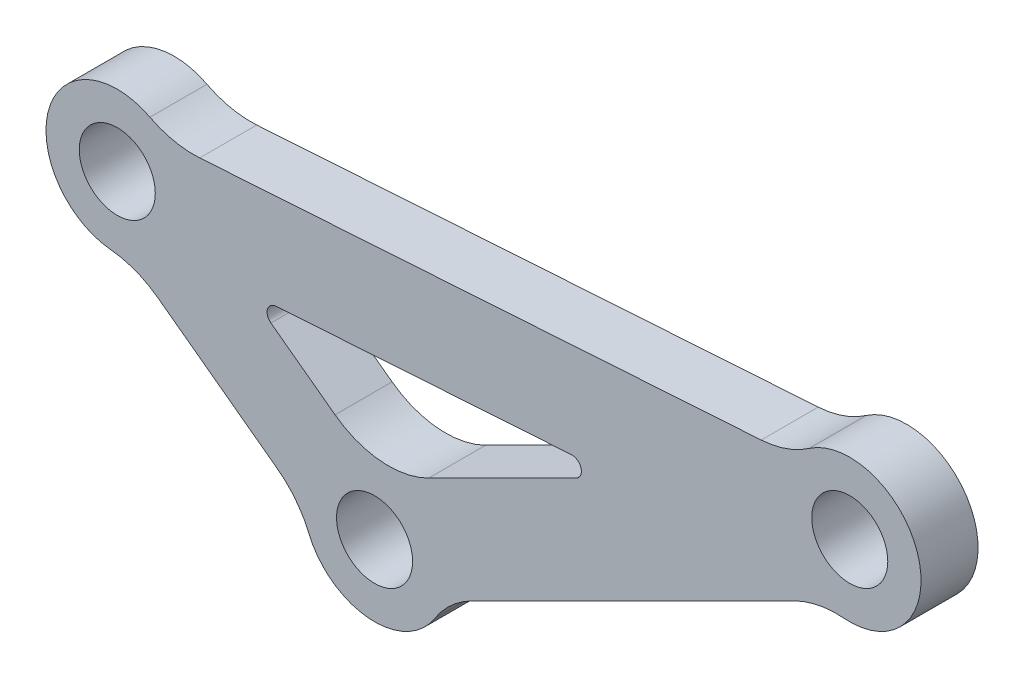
ISO-10303-21;
HEADER;
FILE_DESCRIPTION(('STEP AP214'),'2;1');
FILE_NAME('part.step','',(''),(''),'','','');
FILE_SCHEMA(('AUTOMOTIVE_DESIGN { 1 0 10303 214 1 1 1 1 }'));
ENDSEC;
DATA;
#1=APPLICATION_CONTEXT('core data for automotive mechanical design processes');
#2=APPLICATION_PROTOCOL_DEFINITION('international standard','automotive_design',2000,#1);
#3=PRODUCT_CONTEXT('',#1,'mechanical');
#4=PRODUCT('Part','Part','',(#3));
#5=PRODUCT_RELATED_PRODUCT_CATEGORY('part','',(#4));
#6=PRODUCT_DEFINITION_FORMATION('','',#4);
#7=PRODUCT_DEFINITION_CONTEXT('part definition',#1,'design');
#8=PRODUCT_DEFINITION('design','',#6,#7);
#9=PRODUCT_DEFINITION_SHAPE('','',#8);
#10=(LENGTH_UNIT() NAMED_UNIT(*) SI_UNIT(.MILLI.,.METRE.));
#11=(NAMED_UNIT(*) PLANE_ANGLE_UNIT() SI_UNIT($,.RADIAN.));
#12=(NAMED_UNIT(*) SI_UNIT($,.STERADIAN.) SOLID_ANGLE_UNIT());
#13=UNCERTAINTY_MEASURE_WITH_UNIT(LENGTH_MEASURE(1.E-05),#10,'distance_accuracy_value','');
#14=(GEOMETRIC_REPRESENTATION_CONTEXT(3) GLOBAL_UNCERTAINTY_ASSIGNED_CONTEXT((#13)) GLOBAL_UNIT_ASSIGNED_CONTEXT((#10,
#11,#12)) REPRESENTATION_CONTEXT('',''));
#15=CARTESIAN_POINT('',(0.,0.,0.));
#16=DIRECTION('',(0.,0.,1.));
#17=DIRECTION('',(1.,0.,0.));
#18=AXIS2_PLACEMENT_3D('',#15,#16,#17);
#19=CARTESIAN_POINT('',(-19.047185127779,35.5520836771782,3.));
#20=DIRECTION('',(0.,0.,1.));
#21=DIRECTION('',(1.,0.,0.));
#22=AXIS2_PLACEMENT_3D('',#19,#20,#21);
#23=PLANE('',#22);
#24=CARTESIAN_POINT('',(50.,25.,3.));
#25=DIRECTION('',(0.,0.,1.));
#26=DIRECTION('',(1.,0.,0.));
#27=AXIS2_PLACEMENT_3D('',#24,#25,#26);
#28=CIRCLE('',#27,4.00000000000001);
#29=CARTESIAN_POINT('',(54.,25.,3.));
#30=VERTEX_POINT('',#29);
#31=EDGE_CURVE('E218',#30,#30,#28,.T.);
#32=ORIENTED_EDGE('',*,*,#31,.F.);
#33=EDGE_LOOP('',(#32));
#34=FACE_BOUND('',#33,.T.);
#35=CARTESIAN_POINT('',(-19.047185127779,35.5520836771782,3.));
#36=DIRECTION('',(0.,0.,-1.));
#37=DIRECTION('',(1.,0.,0.));
#38=AXIS2_PLACEMENT_3D('',#35,#36,#37);
#39=CIRCLE('',#38,10.);
#40=CARTESIAN_POINT('',(-18.3997941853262,25.5730614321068,3.));
#41=VERTEX_POINT('',#40);
#42=CARTESIAN_POINT('',(-23.632260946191,26.6651787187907,3.));
#43=VERTEX_POINT('',#42);
#44=EDGE_CURVE('E230',#41,#43,#39,.T.);
#45=ORIENTED_EDGE('',*,*,#44,.T.);
#46=CARTESIAN_POINT('',(-27.07106781,20.,3.));
#47=DIRECTION('',(0.,0.,1.));
#48=DIRECTION('',(1.,0.,0.));
#49=AXIS2_PLACEMENT_3D('',#46,#47,#48);
#50=CIRCLE('',#49,7.5);
#51=CARTESIAN_POINT('',(-27.7839334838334,12.5339553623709,3.));
#52=VERTEX_POINT('',#51);
#53=EDGE_CURVE('E233',#43,#52,#50,.T.);
#54=ORIENTED_EDGE('',*,*,#53,.T.);
#55=CARTESIAN_POINT('',(-28.7344210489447,2.57922917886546,3.));
#56=DIRECTION('',(0.,0.,-1.));
#57=DIRECTION('',(-1.,0.,0.));
#58=AXIS2_PLACEMENT_3D('',#55,#56,#57);
#59=CIRCLE('',#58,10.);
#60=CARTESIAN_POINT('',(-22.7922494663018,10.6222756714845,3.));
#61=VERTEX_POINT('',#60);
#62=EDGE_CURVE('E236',#52,#61,#59,.T.);
#63=ORIENTED_EDGE('',*,*,#62,.T.);
#64=DIRECTION('',(0.804304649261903,-0.594217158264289,0.));
#65=VECTOR('',#64,1.);
#66=CARTESIAN_POINT('',(-10.2209899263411,1.33467783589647,3.));
#67=LINE('',#66,#65);
#68=CARTESIAN_POINT('',(-10.2209899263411,1.33467783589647,3.));
#69=VERTEX_POINT('',#68);
#70=EDGE_CURVE('E238',#61,#69,#67,.T.);
#71=ORIENTED_EDGE('',*,*,#70,.T.);
#72=CARTESIAN_POINT('',(-16.163161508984,-6.70836865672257,3.));
#73=DIRECTION('',(0.,0.,-1.));
#74=DIRECTION('',(1.,0.,0.));
#75=AXIS2_PLACEMENT_3D('',#72,#73,#74);
#76=CIRCLE('',#75,10.);
#77=CARTESIAN_POINT('',(-6.927069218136,-2.87501513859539,3.));
#78=VERTEX_POINT('',#77);
#79=EDGE_CURVE('E240',#69,#78,#76,.T.);
#80=ORIENTED_EDGE('',*,*,#79,.T.);
#81=CARTESIAN_POINT('',(0.,0.,3.));
#82=DIRECTION('',(0.,0.,1.));
#83=DIRECTION('',(1.,0.,0.));
#84=AXIS2_PLACEMENT_3D('',#81,#82,#83);
#85=CIRCLE('',#84,7.5);
#86=CARTESIAN_POINT('',(6.33019786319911,-4.02226242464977,3.));
#87=VERTEX_POINT('',#86);
#88=EDGE_CURVE('E242',#78,#87,#85,.T.);
#89=ORIENTED_EDGE('',*,*,#88,.T.);
#90=CARTESIAN_POINT('',(14.7704616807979,-9.38527899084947,3.));
#91=DIRECTION('',(0.,0.,-1.));
#92=DIRECTION('',(-1.,0.,0.));
#93=AXIS2_PLACEMENT_3D('',#90,#91,#92);
#94=CIRCLE('',#93,10.);
#95=CARTESIAN_POINT('',(10.2983257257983,-0.441007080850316,3.));
#96=VERTEX_POINT('',#95);
#97=EDGE_CURVE('E244',#87,#96,#94,.T.);
#98=ORIENTED_EDGE('',*,*,#97,.T.);
#99=DIRECTION('',(0.894427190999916,0.447213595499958,0.));
#100=VECTOR('',#99,1.);
#101=CARTESIAN_POINT('',(44.1738102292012,16.4967351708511,3.));
#102=LINE('',#101,#100);
#103=CARTESIAN_POINT('',(44.1738102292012,16.4967351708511,3.));
#104=VERTEX_POINT('',#103);
#105=EDGE_CURVE('E246',#96,#104,#102,.T.);
#106=ORIENTED_EDGE('',*,*,#105,.T.);
#107=CARTESIAN_POINT('',(48.6459461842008,7.55246326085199,3.));
#108=DIRECTION('',(0.,0.,-1.));
#109=DIRECTION('',(1.,0.,0.));
#110=AXIS2_PLACEMENT_3D('',#107,#108,#109);
#111=CIRCLE('',#110,10.);
#112=CARTESIAN_POINT('',(49.4196912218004,17.5224842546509,3.));
#113=VERTEX_POINT('',#112);
#114=EDGE_CURVE('E248',#104,#113,#111,.T.);
#115=ORIENTED_EDGE('',*,*,#114,.T.);
#116=CARTESIAN_POINT('',(50.,25.,3.));
#117=DIRECTION('',(0.,0.,1.));
#118=DIRECTION('',(1.,0.,0.));
#119=AXIS2_PLACEMENT_3D('',#116,#117,#118);
#120=CIRCLE('',#119,7.5);
#121=CARTESIAN_POINT('',(45.7288333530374,31.1649927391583,3.));
#122=VERTEX_POINT('',#121);
#123=EDGE_CURVE('E250',#113,#122,#120,.T.);
#124=ORIENTED_EDGE('',*,*,#123,.T.);
#125=CARTESIAN_POINT('',(40.0339444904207,39.384983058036,3.));
#126=DIRECTION('',(0.,0.,-1.));
#127=DIRECTION('',(-1.,0.,0.));
#128=AXIS2_PLACEMENT_3D('',#125,#126,#127);
#129=CIRCLE('',#128,10.);
#130=CARTESIAN_POINT('',(40.6813354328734,29.4059608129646,3.));
#131=VERTEX_POINT('',#130);
#132=EDGE_CURVE('E252',#122,#131,#129,.T.);
#133=ORIENTED_EDGE('',*,*,#132,.T.);
#134=DIRECTION('',(-0.997902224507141,-0.0647390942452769,0.));
#135=VECTOR('',#134,1.);
#136=CARTESIAN_POINT('',(-18.3997941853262,25.5730614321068,3.));
#137=LINE('',#136,#135);
#138=EDGE_CURVE('E254',#131,#41,#137,.T.);
#139=ORIENTED_EDGE('',*,*,#138,.T.);
#140=EDGE_LOOP('',(#45,#54,#63,#71,#80,#89,#98,#106,#115,#124,#133,#139));
#141=FACE_BOUND('',#140,.T.);
#142=CARTESIAN_POINT('',(0.,0.,3.));
#143=DIRECTION('',(0.,0.,1.));
#144=DIRECTION('',(1.,0.,0.));
#145=AXIS2_PLACEMENT_3D('',#142,#143,#144);
#146=CIRCLE('',#145,4.);
#147=CARTESIAN_POINT('',(4.,0.,3.));
#148=VERTEX_POINT('',#147);
#149=EDGE_CURVE('E224',#148,#148,#146,.T.);
#150=ORIENTED_EDGE('',*,*,#149,.F.);
#151=EDGE_LOOP('',(#150));
#152=FACE_BOUND('',#151,.T.);
#153=CARTESIAN_POINT('',(-27.07106781,20.,3.));
#154=DIRECTION('',(0.,0.,1.));
#155=DIRECTION('',(1.,0.,0.));
#156=AXIS2_PLACEMENT_3D('',#153,#154,#155);
#157=CIRCLE('',#156,4.);
#158=CARTESIAN_POINT('',(-23.07106781,20.,3.));
#159=VERTEX_POINT('',#158);
#160=EDGE_CURVE('E212',#159,#159,#157,.T.);
#161=ORIENTED_EDGE('',*,*,#160,.F.);
#162=EDGE_LOOP('',(#161));
#163=FACE_BOUND('',#162,.T.);
#164=DIRECTION('',(0.894427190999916,0.447213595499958,0.));
#165=VECTOR('',#164,1.);
#166=CARTESIAN_POINT('',(5.68953248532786,8.4349361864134,3.));
#167=LINE('',#166,#165);
#168=CARTESIAN_POINT('',(5.68953248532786,8.4349361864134,3.));
#169=VERTEX_POINT('',#168);
#170=CARTESIAN_POINT('',(21.2123442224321,16.1963420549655,3.));
#171=VERTEX_POINT('',#170);
#172=EDGE_CURVE('E169',#169,#171,#167,.T.);
#173=ORIENTED_EDGE('',*,*,#172,.F.);
#174=CARTESIAN_POINT('',(1.46167100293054,16.890659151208,3.));
#175=DIRECTION('',(0.,0.,1.));
#176=DIRECTION('',(1.,0.,0.));
#177=AXIS2_PLACEMENT_3D('',#174,#175,#176);
#178=CIRCLE('',#177,9.45378567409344);
#179=CARTESIAN_POINT('',(-4.15593065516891,9.28693538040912,3.));
#180=VERTEX_POINT('',#179);
#181=EDGE_CURVE('E161',#180,#169,#178,.T.);
#182=ORIENTED_EDGE('',*,*,#181,.F.);
#183=DIRECTION('',(0.804304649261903,-0.594217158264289,0.));
#184=VECTOR('',#183,1.);
#185=CARTESIAN_POINT('',(-10.9016245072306,14.2706278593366,3.));
#186=LINE('',#185,#184);
#187=CARTESIAN_POINT('',(-10.9016245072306,14.2706278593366,3.));
#188=VERTEX_POINT('',#187);
#189=EDGE_CURVE('E190',#188,#180,#186,.T.);
#190=ORIENTED_EDGE('',*,*,#189,.F.);
#191=CARTESIAN_POINT('',(-10.3074073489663,15.0749325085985,3.));
#192=DIRECTION('',(0.,0.,1.));
#193=DIRECTION('',(1.,0.,0.));
#194=AXIS2_PLACEMENT_3D('',#191,#192,#193);
#195=CIRCLE('',#194,0.999999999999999);
#196=CARTESIAN_POINT('',(-10.3721464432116,16.0728347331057,3.));
#197=VERTEX_POINT('',#196);
#198=EDGE_CURVE('E188',#197,#188,#195,.T.);
#199=ORIENTED_EDGE('',*,*,#198,.F.);
#200=DIRECTION('',(-0.997902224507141,-0.0647390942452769,0.));
#201=VECTOR('',#200,1.);
#202=CARTESIAN_POINT('',(-10.3721464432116,16.0728347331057,3.));
#203=LINE('',#202,#201);
#204=CARTESIAN_POINT('',(20.7003915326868,18.0886714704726,3.));
#205=VERTEX_POINT('',#204);
#206=EDGE_CURVE('E184',#205,#197,#203,.T.);
#207=ORIENTED_EDGE('',*,*,#206,.F.);
#208=CARTESIAN_POINT('',(20.7651306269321,17.0907692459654,3.));
#209=DIRECTION('',(0.,0.,1.));
#210=DIRECTION('',(-1.,0.,0.));
#211=AXIS2_PLACEMENT_3D('',#208,#209,#210);
#212=CIRCLE('',#211,1.);
#213=EDGE_CURVE('E182',#171,#205,#212,.T.);
#214=ORIENTED_EDGE('',*,*,#213,.F.);
#215=EDGE_LOOP('',(#173,#182,#190,#199,#207,#214));
#216=FACE_BOUND('',#215,.T.);
#217=ADVANCED_FACE('F36',(#34,#141,#152,#163,#216),#23,.T.);
#218=CARTESIAN_POINT('',(-19.047185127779,35.5520836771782,-3.));
#219=DIRECTION('',(0.,0.,1.));
#220=DIRECTION('',(1.,0.,0.));
#221=AXIS2_PLACEMENT_3D('',#218,#219,#220);
#222=PLANE('',#221);
#223=CARTESIAN_POINT('',(-27.07106781,20.,-3.));
#224=DIRECTION('',(0.,0.,1.));
#225=DIRECTION('',(1.,0.,0.));
#226=AXIS2_PLACEMENT_3D('',#223,#224,#225);
#227=CIRCLE('',#226,4.);
#228=CARTESIAN_POINT('',(-23.07106781,20.,-3.));
#229=VERTEX_POINT('',#228);
#230=EDGE_CURVE('E177',#229,#229,#227,.T.);
#231=ORIENTED_EDGE('',*,*,#230,.T.);
#232=EDGE_LOOP('',(#231));
#233=FACE_BOUND('',#232,.T.);
#234=CARTESIAN_POINT('',(50.,25.,-3.));
#235=DIRECTION('',(0.,0.,1.));
#236=DIRECTION('',(1.,0.,0.));
#237=AXIS2_PLACEMENT_3D('',#234,#235,#236);
#238=CIRCLE('',#237,4.00000000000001);
#239=CARTESIAN_POINT('',(54.,25.,-3.));
#240=VERTEX_POINT('',#239);
#241=EDGE_CURVE('E215',#240,#240,#238,.T.);
#242=ORIENTED_EDGE('',*,*,#241,.T.);
#243=EDGE_LOOP('',(#242));
#244=FACE_BOUND('',#243,.T.);
#245=CARTESIAN_POINT('',(0.,0.,-3.));
#246=DIRECTION('',(0.,0.,1.));
#247=DIRECTION('',(1.,0.,0.));
#248=AXIS2_PLACEMENT_3D('',#245,#246,#247);
#249=CIRCLE('',#248,4.);
#250=CARTESIAN_POINT('',(4.,0.,-3.));
#251=VERTEX_POINT('',#250);
#252=EDGE_CURVE('E221',#251,#251,#249,.T.);
#253=ORIENTED_EDGE('',*,*,#252,.T.);
#254=EDGE_LOOP('',(#253));
#255=FACE_BOUND('',#254,.T.);
#256=CARTESIAN_POINT('',(-19.047185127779,35.5520836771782,-3.));
#257=DIRECTION('',(0.,0.,-1.));
#258=DIRECTION('',(1.,0.,0.));
#259=AXIS2_PLACEMENT_3D('',#256,#257,#258);
#260=CIRCLE('',#259,10.);
#261=CARTESIAN_POINT('',(-18.3997941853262,25.5730614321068,-3.));
#262=VERTEX_POINT('',#261);
#263=CARTESIAN_POINT('',(-23.632260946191,26.6651787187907,-3.));
#264=VERTEX_POINT('',#263);
#265=EDGE_CURVE('E227',#262,#264,#260,.T.);
#266=ORIENTED_EDGE('',*,*,#265,.F.);
#267=DIRECTION('',(-0.997902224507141,-0.0647390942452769,0.));
#268=VECTOR('',#267,1.);
#269=CARTESIAN_POINT('',(-18.3997941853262,25.5730614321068,-3.));
#270=LINE('',#269,#268);
#271=CARTESIAN_POINT('',(40.6813354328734,29.4059608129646,-3.));
#272=VERTEX_POINT('',#271);
#273=EDGE_CURVE('E234',#272,#262,#270,.T.);
#274=ORIENTED_EDGE('',*,*,#273,.F.);
#275=CARTESIAN_POINT('',(40.0339444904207,39.384983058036,-3.));
#276=DIRECTION('',(0.,0.,-1.));
#277=DIRECTION('',(-1.,0.,0.));
#278=AXIS2_PLACEMENT_3D('',#275,#276,#277);
#279=CIRCLE('',#278,10.);
#280=CARTESIAN_POINT('',(45.7288333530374,31.1649927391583,-3.));
#281=VERTEX_POINT('',#280);
#282=EDGE_CURVE('E277',#281,#272,#279,.T.);
#283=ORIENTED_EDGE('',*,*,#282,.F.);
#284=CARTESIAN_POINT('',(50.,25.,-3.));
#285=DIRECTION('',(0.,0.,1.));
#286=DIRECTION('',(1.,0.,0.));
#287=AXIS2_PLACEMENT_3D('',#284,#285,#286);
#288=CIRCLE('',#287,7.5);
#289=CARTESIAN_POINT('',(49.4196912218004,17.5224842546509,-3.));
#290=VERTEX_POINT('',#289);
#291=EDGE_CURVE('E275',#290,#281,#288,.T.);
#292=ORIENTED_EDGE('',*,*,#291,.F.);
#293=CARTESIAN_POINT('',(48.6459461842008,7.55246326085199,-3.));
#294=DIRECTION('',(0.,0.,-1.));
#295=DIRECTION('',(1.,0.,0.));
#296=AXIS2_PLACEMENT_3D('',#293,#294,#295);
#297=CIRCLE('',#296,10.);
#298=CARTESIAN_POINT('',(44.1738102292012,16.4967351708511,-3.));
#299=VERTEX_POINT('',#298);
#300=EDGE_CURVE('E273',#299,#290,#297,.T.);
#301=ORIENTED_EDGE('',*,*,#300,.F.);
#302=DIRECTION('',(0.894427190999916,0.447213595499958,0.));
#303=VECTOR('',#302,1.);
#304=CARTESIAN_POINT('',(44.1738102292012,16.4967351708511,-3.));
#305=LINE('',#304,#303);
#306=CARTESIAN_POINT('',(10.2983257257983,-0.441007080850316,-3.));
#307=VERTEX_POINT('',#306);
#308=EDGE_CURVE('E271',#307,#299,#305,.T.);
#309=ORIENTED_EDGE('',*,*,#308,.F.);
#310=CARTESIAN_POINT('',(14.7704616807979,-9.38527899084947,-3.));
#311=DIRECTION('',(0.,0.,-1.));
#312=DIRECTION('',(-1.,0.,0.));
#313=AXIS2_PLACEMENT_3D('',#310,#311,#312);
#314=CIRCLE('',#313,10.);
#315=CARTESIAN_POINT('',(6.33019786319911,-4.02226242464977,-3.));
#316=VERTEX_POINT('',#315);
#317=EDGE_CURVE('E269',#316,#307,#314,.T.);
#318=ORIENTED_EDGE('',*,*,#317,.F.);
#319=CARTESIAN_POINT('',(0.,0.,-3.));
#320=DIRECTION('',(0.,0.,1.));
#321=DIRECTION('',(1.,0.,0.));
#322=AXIS2_PLACEMENT_3D('',#319,#320,#321);
#323=CIRCLE('',#322,7.5);
#324=CARTESIAN_POINT('',(-6.927069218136,-2.87501513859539,-3.));
#325=VERTEX_POINT('',#324);
#326=EDGE_CURVE('E267',#325,#316,#323,.T.);
#327=ORIENTED_EDGE('',*,*,#326,.F.);
#328=CARTESIAN_POINT('',(-16.163161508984,-6.70836865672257,-3.));
#329=DIRECTION('',(0.,0.,-1.));
#330=DIRECTION('',(1.,0.,0.));
#331=AXIS2_PLACEMENT_3D('',#328,#329,#330);
#332=CIRCLE('',#331,10.);
#333=CARTESIAN_POINT('',(-10.2209899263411,1.33467783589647,-3.));
#334=VERTEX_POINT('',#333);
#335=EDGE_CURVE('E265',#334,#325,#332,.T.);
#336=ORIENTED_EDGE('',*,*,#335,.F.);
#337=DIRECTION('',(0.804304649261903,-0.594217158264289,0.));
#338=VECTOR('',#337,1.);
#339=CARTESIAN_POINT('',(-10.2209899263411,1.33467783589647,-3.));
#340=LINE('',#339,#338);
#341=CARTESIAN_POINT('',(-22.7922494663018,10.6222756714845,-3.));
#342=VERTEX_POINT('',#341);
#343=EDGE_CURVE('E263',#342,#334,#340,.T.);
#344=ORIENTED_EDGE('',*,*,#343,.F.);
#345=CARTESIAN_POINT('',(-28.7344210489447,2.57922917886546,-3.));
#346=DIRECTION('',(0.,0.,-1.));
#347=DIRECTION('',(-1.,0.,0.));
#348=AXIS2_PLACEMENT_3D('',#345,#346,#347);
#349=CIRCLE('',#348,10.);
#350=CARTESIAN_POINT('',(-27.7839334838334,12.5339553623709,-3.));
#351=VERTEX_POINT('',#350);
#352=EDGE_CURVE('E261',#351,#342,#349,.T.);
#353=ORIENTED_EDGE('',*,*,#352,.F.);
#354=CARTESIAN_POINT('',(-27.07106781,20.,-3.));
#355=DIRECTION('',(0.,0.,1.));
#356=DIRECTION('',(1.,0.,0.));
#357=AXIS2_PLACEMENT_3D('',#354,#355,#356);
#358=CIRCLE('',#357,7.5);
#359=EDGE_CURVE('E259',#264,#351,#358,.T.);
#360=ORIENTED_EDGE('',*,*,#359,.F.);
#361=EDGE_LOOP('',(#266,#274,#283,#292,#301,#309,#318,#327,#336,#344,#353,#360));
#362=FACE_BOUND('',#361,.T.);
#363=CARTESIAN_POINT('',(1.46167100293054,16.890659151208,-3.));
#364=DIRECTION('',(0.,0.,1.));
#365=DIRECTION('',(1.,0.,0.));
#366=AXIS2_PLACEMENT_3D('',#363,#364,#365);
#367=CIRCLE('',#366,9.45378567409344);
#368=CARTESIAN_POINT('',(-4.1559306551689,9.28693538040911,-3.));
#369=VERTEX_POINT('',#368);
#370=CARTESIAN_POINT('',(5.68953248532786,8.4349361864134,-3.));
#371=VERTEX_POINT('',#370);
#372=EDGE_CURVE('E59',#369,#371,#367,.T.);
#373=ORIENTED_EDGE('',*,*,#372,.T.);
#374=DIRECTION('',(0.894427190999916,0.447213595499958,0.));
#375=VECTOR('',#374,1.);
#376=CARTESIAN_POINT('',(5.68953248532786,8.4349361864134,-3.));
#377=LINE('',#376,#375);
#378=CARTESIAN_POINT('',(21.2123442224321,16.1963420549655,-3.));
#379=VERTEX_POINT('',#378);
#380=EDGE_CURVE('E176',#371,#379,#377,.T.);
#381=ORIENTED_EDGE('',*,*,#380,.T.);
#382=CARTESIAN_POINT('',(20.7651306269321,17.0907692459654,-3.));
#383=DIRECTION('',(0.,0.,1.));
#384=DIRECTION('',(-1.,0.,0.));
#385=AXIS2_PLACEMENT_3D('',#382,#383,#384);
#386=CIRCLE('',#385,1.);
#387=CARTESIAN_POINT('',(20.7003915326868,18.0886714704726,-3.));
#388=VERTEX_POINT('',#387);
#389=EDGE_CURVE('E194',#379,#388,#386,.T.);
#390=ORIENTED_EDGE('',*,*,#389,.T.);
#391=DIRECTION('',(-0.997902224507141,-0.0647390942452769,0.));
#392=VECTOR('',#391,1.);
#393=CARTESIAN_POINT('',(-10.3721464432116,16.0728347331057,-3.));
#394=LINE('',#393,#392);
#395=CARTESIAN_POINT('',(-10.3721464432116,16.0728347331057,-3.));
#396=VERTEX_POINT('',#395);
#397=EDGE_CURVE('E197',#388,#396,#394,.T.);
#398=ORIENTED_EDGE('',*,*,#397,.T.);
#399=CARTESIAN_POINT('',(-10.3074073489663,15.0749325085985,-3.));
#400=DIRECTION('',(0.,0.,1.));
#401=DIRECTION('',(1.,0.,0.));
#402=AXIS2_PLACEMENT_3D('',#399,#400,#401);
#403=CIRCLE('',#402,0.999999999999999);
#404=CARTESIAN_POINT('',(-10.9016245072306,14.2706278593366,-3.));
#405=VERTEX_POINT('',#404);
#406=EDGE_CURVE('E200',#396,#405,#403,.T.);
#407=ORIENTED_EDGE('',*,*,#406,.T.);
#408=DIRECTION('',(0.804304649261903,-0.594217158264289,0.));
#409=VECTOR('',#408,1.);
#410=CARTESIAN_POINT('',(-10.9016245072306,14.2706278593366,-3.));
#411=LINE('',#410,#409);
#412=EDGE_CURVE('E170',#405,#369,#411,.T.);
#413=ORIENTED_EDGE('',*,*,#412,.T.);
#414=EDGE_LOOP('',(#373,#381,#390,#398,#407,#413));
#415=FACE_BOUND('',#414,.T.);
#416=ADVANCED_FACE('F319',(#233,#244,#255,#362,#415),#222,.F.);
#417=CARTESIAN_POINT('',(-19.047185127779,35.5520836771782,3.));
#418=DIRECTION('',(0.,0.,-1.));
#419=DIRECTION('',(-1.,0.,0.));
#420=AXIS2_PLACEMENT_3D('',#417,#418,#419);
#421=CYLINDRICAL_SURFACE('',#420,10.);
#422=ORIENTED_EDGE('',*,*,#265,.T.);
#423=DIRECTION('',(0.,0.,-1.));
#424=VECTOR('',#423,1.);
#425=CARTESIAN_POINT('',(-23.632260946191,26.6651787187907,3.));
#426=LINE('',#425,#424);
#427=EDGE_CURVE('E11',#43,#264,#426,.T.);
#428=ORIENTED_EDGE('',*,*,#427,.F.);
#429=ORIENTED_EDGE('',*,*,#44,.F.);
#430=DIRECTION('',(0.,0.,-1.));
#431=VECTOR('',#430,1.);
#432=CARTESIAN_POINT('',(-18.3997941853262,25.5730614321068,3.));
#433=LINE('',#432,#431);
#434=EDGE_CURVE('E256',#41,#262,#433,.T.);
#435=ORIENTED_EDGE('',*,*,#434,.T.);
#436=EDGE_LOOP('',(#422,#428,#429,#435));
#437=FACE_BOUND('',#436,.T.);
#438=ADVANCED_FACE('F38',(#437),#421,.F.);
#439=CARTESIAN_POINT('',(-27.07106781,20.,3.));
#440=DIRECTION('',(0.,0.,-1.));
#441=DIRECTION('',(-1.,0.,0.));
#442=AXIS2_PLACEMENT_3D('',#439,#440,#441);
#443=CYLINDRICAL_SURFACE('',#442,7.5);
#444=ORIENTED_EDGE('',*,*,#359,.T.);
#445=DIRECTION('',(0.,0.,-1.));
#446=VECTOR('',#445,1.);
#447=CARTESIAN_POINT('',(-27.7839334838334,12.5339553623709,3.));
#448=LINE('',#447,#446);
#449=EDGE_CURVE('E44',#52,#351,#448,.T.);
#450=ORIENTED_EDGE('',*,*,#449,.F.);
#451=ORIENTED_EDGE('',*,*,#53,.F.);
#452=ORIENTED_EDGE('',*,*,#427,.T.);
#453=EDGE_LOOP('',(#444,#450,#451,#452));
#454=FACE_BOUND('',#453,.T.);
#455=ADVANCED_FACE('F337',(#454),#443,.T.);
#456=CARTESIAN_POINT('',(-28.7344210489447,2.57922917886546,3.));
#457=DIRECTION('',(0.,0.,-1.));
#458=DIRECTION('',(-1.,0.,0.));
#459=AXIS2_PLACEMENT_3D('',#456,#457,#458);
#460=CYLINDRICAL_SURFACE('',#459,10.);
#461=ORIENTED_EDGE('',*,*,#352,.T.);
#462=DIRECTION('',(0.,0.,-1.));
#463=VECTOR('',#462,1.);
#464=CARTESIAN_POINT('',(-22.7922494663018,10.6222756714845,3.));
#465=LINE('',#464,#463);
#466=EDGE_CURVE('E306',#61,#342,#465,.T.);
#467=ORIENTED_EDGE('',*,*,#466,.F.);
#468=ORIENTED_EDGE('',*,*,#62,.F.);
#469=ORIENTED_EDGE('',*,*,#449,.T.);
#470=EDGE_LOOP('',(#461,#467,#468,#469));
#471=FACE_BOUND('',#470,.T.);
#472=ADVANCED_FACE('F313',(#471),#460,.F.);
#473=CARTESIAN_POINT('',(-10.2209899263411,1.33467783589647,3.));
#474=DIRECTION('',(0.594217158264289,0.804304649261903,0.));
#475=DIRECTION('',(-0.804304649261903,0.594217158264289,0.));
#476=AXIS2_PLACEMENT_3D('',#473,#474,#475);
#477=PLANE('',#476);
#478=ORIENTED_EDGE('',*,*,#343,.T.);
#479=DIRECTION('',(0.,0.,-1.));
#480=VECTOR('',#479,1.);
#481=CARTESIAN_POINT('',(-10.2209899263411,1.33467783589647,3.));
#482=LINE('',#481,#480);
#483=EDGE_CURVE('E303',#69,#334,#482,.T.);
#484=ORIENTED_EDGE('',*,*,#483,.F.);
#485=ORIENTED_EDGE('',*,*,#70,.F.);
#486=ORIENTED_EDGE('',*,*,#466,.T.);
#487=EDGE_LOOP('',(#478,#484,#485,#486));
#488=FACE_BOUND('',#487,.T.);
#489=ADVANCED_FACE('F325',(#488),#477,.F.);
#490=CARTESIAN_POINT('',(-16.163161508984,-6.70836865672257,3.));
#491=DIRECTION('',(0.,0.,-1.));
#492=DIRECTION('',(-1.,0.,0.));
#493=AXIS2_PLACEMENT_3D('',#490,#491,#492);
#494=CYLINDRICAL_SURFACE('',#493,10.);
#495=ORIENTED_EDGE('',*,*,#335,.T.);
#496=DIRECTION('',(0.,0.,-1.));
#497=VECTOR('',#496,1.);
#498=CARTESIAN_POINT('',(-6.927069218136,-2.87501513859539,3.));
#499=LINE('',#498,#497);
#500=EDGE_CURVE('E300',#78,#325,#499,.T.);
#501=ORIENTED_EDGE('',*,*,#500,.F.);
#502=ORIENTED_EDGE('',*,*,#79,.F.);
#503=ORIENTED_EDGE('',*,*,#483,.T.);
#504=EDGE_LOOP('',(#495,#501,#502,#503));
#505=FACE_BOUND('',#504,.T.);
#506=ADVANCED_FACE('F329',(#505),#494,.F.);
#507=CARTESIAN_POINT('',(0.,0.,3.));
#508=DIRECTION('',(0.,0.,-1.));
#509=DIRECTION('',(-1.,0.,0.));
#510=AXIS2_PLACEMENT_3D('',#507,#508,#509);
#511=CYLINDRICAL_SURFACE('',#510,7.5);
#512=ORIENTED_EDGE('',*,*,#326,.T.);
#513=DIRECTION('',(0.,0.,-1.));
#514=VECTOR('',#513,1.);
#515=CARTESIAN_POINT('',(6.33019786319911,-4.02226242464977,3.));
#516=LINE('',#515,#514);
#517=EDGE_CURVE('E297',#87,#316,#516,.T.);
#518=ORIENTED_EDGE('',*,*,#517,.F.);
#519=ORIENTED_EDGE('',*,*,#88,.F.);
#520=ORIENTED_EDGE('',*,*,#500,.T.);
#521=EDGE_LOOP('',(#512,#518,#519,#520));
#522=FACE_BOUND('',#521,.T.);
#523=ADVANCED_FACE('F370',(#522),#511,.T.);
#524=CARTESIAN_POINT('',(14.7704616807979,-9.38527899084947,3.));
#525=DIRECTION('',(0.,0.,-1.));
#526=DIRECTION('',(-1.,0.,0.));
#527=AXIS2_PLACEMENT_3D('',#524,#525,#526);
#528=CYLINDRICAL_SURFACE('',#527,10.);
#529=ORIENTED_EDGE('',*,*,#317,.T.);
#530=DIRECTION('',(0.,0.,-1.));
#531=VECTOR('',#530,1.);
#532=CARTESIAN_POINT('',(10.2983257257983,-0.441007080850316,3.));
#533=LINE('',#532,#531);
#534=EDGE_CURVE('E294',#96,#307,#533,.T.);
#535=ORIENTED_EDGE('',*,*,#534,.F.);
#536=ORIENTED_EDGE('',*,*,#97,.F.);
#537=ORIENTED_EDGE('',*,*,#517,.T.);
#538=EDGE_LOOP('',(#529,#535,#536,#537));
#539=FACE_BOUND('',#538,.T.);
#540=ADVANCED_FACE('F368',(#539),#528,.F.);
#541=CARTESIAN_POINT('',(44.1738102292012,16.4967351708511,3.));
#542=DIRECTION('',(-0.447213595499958,0.894427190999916,0.));
#543=DIRECTION('',(-0.894427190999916,-0.447213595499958,0.));
#544=AXIS2_PLACEMENT_3D('',#541,#542,#543);
#545=PLANE('',#544);
#546=ORIENTED_EDGE('',*,*,#308,.T.);
#547=DIRECTION('',(0.,0.,-1.));
#548=VECTOR('',#547,1.);
#549=CARTESIAN_POINT('',(44.1738102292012,16.4967351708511,3.));
#550=LINE('',#549,#548);
#551=EDGE_CURVE('E291',#104,#299,#550,.T.);
#552=ORIENTED_EDGE('',*,*,#551,.F.);
#553=ORIENTED_EDGE('',*,*,#105,.F.);
#554=ORIENTED_EDGE('',*,*,#534,.T.);
#555=EDGE_LOOP('',(#546,#552,#553,#554));
#556=FACE_BOUND('',#555,.T.);
#557=ADVANCED_FACE('F364',(#556),#545,.F.);
#558=CARTESIAN_POINT('',(48.6459461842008,7.55246326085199,3.));
#559=DIRECTION('',(0.,0.,-1.));
#560=DIRECTION('',(-1.,0.,0.));
#561=AXIS2_PLACEMENT_3D('',#558,#559,#560);
#562=CYLINDRICAL_SURFACE('',#561,10.);
#563=ORIENTED_EDGE('',*,*,#300,.T.);
#564=DIRECTION('',(0.,0.,-1.));
#565=VECTOR('',#564,1.);
#566=CARTESIAN_POINT('',(49.4196912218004,17.5224842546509,3.));
#567=LINE('',#566,#565);
#568=EDGE_CURVE('E288',#113,#290,#567,.T.);
#569=ORIENTED_EDGE('',*,*,#568,.F.);
#570=ORIENTED_EDGE('',*,*,#114,.F.);
#571=ORIENTED_EDGE('',*,*,#551,.T.);
#572=EDGE_LOOP('',(#563,#569,#570,#571));
#573=FACE_BOUND('',#572,.T.);
#574=ADVANCED_FACE('F359',(#573),#562,.F.);
#575=CARTESIAN_POINT('',(50.,25.,3.));
#576=DIRECTION('',(0.,0.,-1.));
#577=DIRECTION('',(-1.,0.,0.));
#578=AXIS2_PLACEMENT_3D('',#575,#576,#577);
#579=CYLINDRICAL_SURFACE('',#578,7.5);
#580=ORIENTED_EDGE('',*,*,#291,.T.);
#581=DIRECTION('',(0.,0.,-1.));
#582=VECTOR('',#581,1.);
#583=CARTESIAN_POINT('',(45.7288333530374,31.1649927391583,3.));
#584=LINE('',#583,#582);
#585=EDGE_CURVE('E285',#122,#281,#584,.T.);
#586=ORIENTED_EDGE('',*,*,#585,.F.);
#587=ORIENTED_EDGE('',*,*,#123,.F.);
#588=ORIENTED_EDGE('',*,*,#568,.T.);
#589=EDGE_LOOP('',(#580,#586,#587,#588));
#590=FACE_BOUND('',#589,.T.);
#591=ADVANCED_FACE('F353',(#590),#579,.T.);
#592=CARTESIAN_POINT('',(40.0339444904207,39.384983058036,3.));
#593=DIRECTION('',(0.,0.,-1.));
#594=DIRECTION('',(-1.,0.,0.));
#595=AXIS2_PLACEMENT_3D('',#592,#593,#594);
#596=CYLINDRICAL_SURFACE('',#595,10.);
#597=ORIENTED_EDGE('',*,*,#282,.T.);
#598=DIRECTION('',(0.,0.,-1.));
#599=VECTOR('',#598,1.);
#600=CARTESIAN_POINT('',(40.6813354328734,29.4059608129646,3.));
#601=LINE('',#600,#599);
#602=EDGE_CURVE('E282',#131,#272,#601,.T.);
#603=ORIENTED_EDGE('',*,*,#602,.F.);
#604=ORIENTED_EDGE('',*,*,#132,.F.);
#605=ORIENTED_EDGE('',*,*,#585,.T.);
#606=EDGE_LOOP('',(#597,#603,#604,#605));
#607=FACE_BOUND('',#606,.T.);
#608=ADVANCED_FACE('F349',(#607),#596,.F.);
#609=CARTESIAN_POINT('',(-18.3997941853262,25.5730614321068,3.));
#610=DIRECTION('',(0.0647390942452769,-0.997902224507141,0.));
#611=DIRECTION('',(0.997902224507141,0.0647390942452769,0.));
#612=AXIS2_PLACEMENT_3D('',#609,#610,#611);
#613=PLANE('',#612);
#614=ORIENTED_EDGE('',*,*,#273,.T.);
#615=ORIENTED_EDGE('',*,*,#434,.F.);
#616=ORIENTED_EDGE('',*,*,#138,.F.);
#617=ORIENTED_EDGE('',*,*,#602,.T.);
#618=EDGE_LOOP('',(#614,#615,#616,#617));
#619=FACE_BOUND('',#618,.T.);
#620=ADVANCED_FACE('F344',(#619),#613,.F.);
#621=CARTESIAN_POINT('',(0.,0.,3.));
#622=DIRECTION('',(0.,0.,-1.));
#623=DIRECTION('',(-1.,0.,0.));
#624=AXIS2_PLACEMENT_3D('',#621,#622,#623);
#625=CYLINDRICAL_SURFACE('',#624,4.);
#626=ORIENTED_EDGE('',*,*,#149,.T.);
#627=EDGE_LOOP('',(#626));
#628=FACE_BOUND('',#627,.T.);
#629=ORIENTED_EDGE('',*,*,#252,.F.);
#630=EDGE_LOOP('',(#629));
#631=FACE_BOUND('',#630,.T.);
#632=ADVANCED_FACE('F389',(#628,#631),#625,.F.);
#633=CARTESIAN_POINT('',(50.,25.,3.));
#634=DIRECTION('',(0.,0.,-1.));
#635=DIRECTION('',(-1.,0.,0.));
#636=AXIS2_PLACEMENT_3D('',#633,#634,#635);
#637=CYLINDRICAL_SURFACE('',#636,4.00000000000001);
#638=ORIENTED_EDGE('',*,*,#31,.T.);
#639=EDGE_LOOP('',(#638));
#640=FACE_BOUND('',#639,.T.);
#641=ORIENTED_EDGE('',*,*,#241,.F.);
#642=EDGE_LOOP('',(#641));
#643=FACE_BOUND('',#642,.T.);
#644=ADVANCED_FACE('F427',(#640,#643),#637,.F.);
#645=CARTESIAN_POINT('',(-27.07106781,20.,3.));
#646=DIRECTION('',(0.,0.,-1.));
#647=DIRECTION('',(-1.,0.,0.));
#648=AXIS2_PLACEMENT_3D('',#645,#646,#647);
#649=CYLINDRICAL_SURFACE('',#648,4.);
#650=ORIENTED_EDGE('',*,*,#160,.T.);
#651=EDGE_LOOP('',(#650));
#652=FACE_BOUND('',#651,.T.);
#653=ORIENTED_EDGE('',*,*,#230,.F.);
#654=EDGE_LOOP('',(#653));
#655=FACE_BOUND('',#654,.T.);
#656=ADVANCED_FACE('F434',(#652,#655),#649,.F.);
#657=CARTESIAN_POINT('',(1.46167100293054,16.890659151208,3.));
#658=DIRECTION('',(0.,0.,-1.));
#659=DIRECTION('',(-1.,0.,0.));
#660=AXIS2_PLACEMENT_3D('',#657,#658,#659);
#661=CYLINDRICAL_SURFACE('',#660,9.45378567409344);
#662=ORIENTED_EDGE('',*,*,#372,.F.);
#663=DIRECTION('',(0.,0.,-1.));
#664=VECTOR('',#663,1.);
#665=CARTESIAN_POINT('',(-4.15593065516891,9.28693538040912,3.));
#666=LINE('',#665,#664);
#667=EDGE_CURVE('E165',#180,#369,#666,.T.);
#668=ORIENTED_EDGE('',*,*,#667,.F.);
#669=ORIENTED_EDGE('',*,*,#181,.T.);
#670=DIRECTION('',(0.,0.,-1.));
#671=VECTOR('',#670,1.);
#672=CARTESIAN_POINT('',(5.68953248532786,8.4349361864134,3.));
#673=LINE('',#672,#671);
#674=EDGE_CURVE('E164',#169,#371,#673,.T.);
#675=ORIENTED_EDGE('',*,*,#674,.T.);
#676=EDGE_LOOP('',(#662,#668,#669,#675));
#677=FACE_BOUND('',#676,.T.);
#678=ADVANCED_FACE('F163',(#677),#661,.F.);
#679=CARTESIAN_POINT('',(5.68953248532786,8.4349361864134,3.));
#680=DIRECTION('',(-0.447213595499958,0.894427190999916,0.));
#681=DIRECTION('',(-0.894427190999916,-0.447213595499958,0.));
#682=AXIS2_PLACEMENT_3D('',#679,#680,#681);
#683=PLANE('',#682);
#684=ORIENTED_EDGE('',*,*,#380,.F.);
#685=ORIENTED_EDGE('',*,*,#674,.F.);
#686=ORIENTED_EDGE('',*,*,#172,.T.);
#687=DIRECTION('',(0.,0.,-1.));
#688=VECTOR('',#687,1.);
#689=CARTESIAN_POINT('',(21.2123442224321,16.1963420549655,3.));
#690=LINE('',#689,#688);
#691=EDGE_CURVE('E178',#171,#379,#690,.T.);
#692=ORIENTED_EDGE('',*,*,#691,.T.);
#693=EDGE_LOOP('',(#684,#685,#686,#692));
#694=FACE_BOUND('',#693,.T.);
#695=ADVANCED_FACE('F173',(#694),#683,.T.);
#696=CARTESIAN_POINT('',(20.7651306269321,17.0907692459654,3.));
#697=DIRECTION('',(0.,0.,-1.));
#698=DIRECTION('',(-1.,0.,0.));
#699=AXIS2_PLACEMENT_3D('',#696,#697,#698);
#700=CYLINDRICAL_SURFACE('',#699,1.);
#701=ORIENTED_EDGE('',*,*,#389,.F.);
#702=ORIENTED_EDGE('',*,*,#691,.F.);
#703=ORIENTED_EDGE('',*,*,#213,.T.);
#704=DIRECTION('',(0.,0.,-1.));
#705=VECTOR('',#704,1.);
#706=CARTESIAN_POINT('',(20.7003915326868,18.0886714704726,3.));
#707=LINE('',#706,#705);
#708=EDGE_CURVE('E209',#205,#388,#707,.T.);
#709=ORIENTED_EDGE('',*,*,#708,.T.);
#710=EDGE_LOOP('',(#701,#702,#703,#709));
#711=FACE_BOUND('',#710,.T.);
#712=ADVANCED_FACE('F454',(#711),#700,.F.);
#713=CARTESIAN_POINT('',(-10.3721464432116,16.0728347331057,3.));
#714=DIRECTION('',(0.0647390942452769,-0.997902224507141,0.));
#715=DIRECTION('',(0.997902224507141,0.0647390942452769,0.));
#716=AXIS2_PLACEMENT_3D('',#713,#714,#715);
#717=PLANE('',#716);
#718=ORIENTED_EDGE('',*,*,#397,.F.);
#719=ORIENTED_EDGE('',*,*,#708,.F.);
#720=ORIENTED_EDGE('',*,*,#206,.T.);
#721=DIRECTION('',(0.,0.,-1.));
#722=VECTOR('',#721,1.);
#723=CARTESIAN_POINT('',(-10.3721464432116,16.0728347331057,3.));
#724=LINE('',#723,#722);
#725=EDGE_CURVE('E207',#197,#396,#724,.T.);
#726=ORIENTED_EDGE('',*,*,#725,.T.);
#727=EDGE_LOOP('',(#718,#719,#720,#726));
#728=FACE_BOUND('',#727,.T.);
#729=ADVANCED_FACE('F461',(#728),#717,.T.);
#730=CARTESIAN_POINT('',(-10.3074073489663,15.0749325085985,3.));
#731=DIRECTION('',(0.,0.,-1.));
#732=DIRECTION('',(-1.,0.,0.));
#733=AXIS2_PLACEMENT_3D('',#730,#731,#732);
#734=CYLINDRICAL_SURFACE('',#733,0.999999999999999);
#735=ORIENTED_EDGE('',*,*,#406,.F.);
#736=ORIENTED_EDGE('',*,*,#725,.F.);
#737=ORIENTED_EDGE('',*,*,#198,.T.);
#738=DIRECTION('',(0.,0.,-1.));
#739=VECTOR('',#738,1.);
#740=CARTESIAN_POINT('',(-10.9016245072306,14.2706278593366,3.));
#741=LINE('',#740,#739);
#742=EDGE_CURVE('E51',#188,#405,#741,.T.);
#743=ORIENTED_EDGE('',*,*,#742,.T.);
#744=EDGE_LOOP('',(#735,#736,#737,#743));
#745=FACE_BOUND('',#744,.T.);
#746=ADVANCED_FACE('F469',(#745),#734,.F.);
#747=CARTESIAN_POINT('',(-10.9016245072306,14.2706278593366,3.));
#748=DIRECTION('',(0.594217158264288,0.804304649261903,0.));
#749=DIRECTION('',(-0.804304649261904,0.594217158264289,0.));
#750=AXIS2_PLACEMENT_3D('',#747,#748,#749);
#751=PLANE('',#750);
#752=ORIENTED_EDGE('',*,*,#412,.F.);
#753=ORIENTED_EDGE('',*,*,#742,.F.);
#754=ORIENTED_EDGE('',*,*,#189,.T.);
#755=ORIENTED_EDGE('',*,*,#667,.T.);
#756=EDGE_LOOP('',(#752,#753,#754,#755));
#757=FACE_BOUND('',#756,.T.);
#758=ADVANCED_FACE('F477',(#757),#751,.T.);
#759=CLOSED_SHELL('',(#217,#416,#438,#455,#472,#489,#506,#523,#540,#557,#574,#591,#608,#620,
#632,#644,#656,#678,#695,#712,#729,#746,#758));
#760=MANIFOLD_SOLID_BREP('B2',#759);
#761=ADVANCED_BREP_SHAPE_REPRESENTATION('',(#18,#760),#14);
#762=SHAPE_DEFINITION_REPRESENTATION(#9,#761);
ENDSEC;
END-ISO-10303-21;
